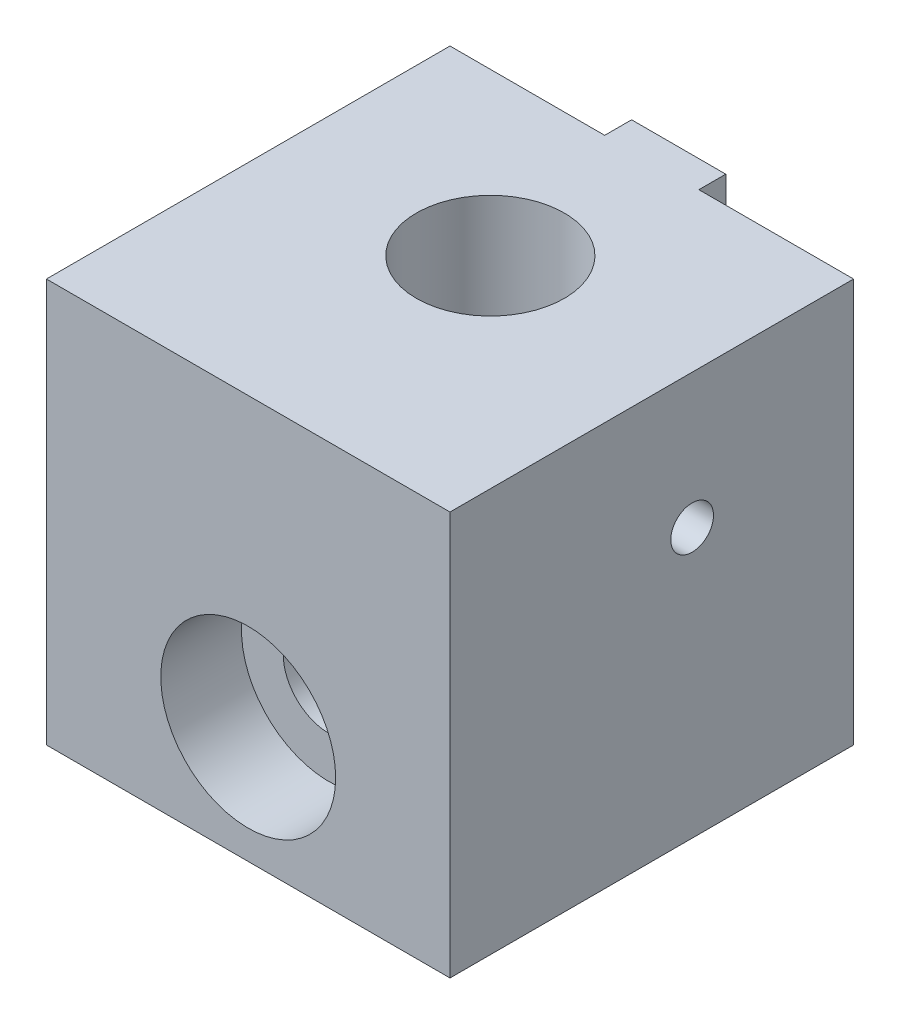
ISO-10303-21;
HEADER;
FILE_DESCRIPTION(('STEP AP214'),'2;1');
FILE_NAME('part.step','',(''),(''),'','','');
FILE_SCHEMA(('AUTOMOTIVE_DESIGN { 1 0 10303 214 1 1 1 1 }'));
ENDSEC;
DATA;
#1=APPLICATION_CONTEXT('core data for automotive mechanical design processes');
#2=APPLICATION_PROTOCOL_DEFINITION('international standard','automotive_design',2000,#1);
#3=PRODUCT_CONTEXT('',#1,'mechanical');
#4=PRODUCT('Part','Part','',(#3));
#5=PRODUCT_RELATED_PRODUCT_CATEGORY('part','',(#4));
#6=PRODUCT_DEFINITION_FORMATION('','',#4);
#7=PRODUCT_DEFINITION_CONTEXT('part definition',#1,'design');
#8=PRODUCT_DEFINITION('design','',#6,#7);
#9=PRODUCT_DEFINITION_SHAPE('','',#8);
#10=(LENGTH_UNIT() NAMED_UNIT(*) SI_UNIT(.MILLI.,.METRE.));
#11=(NAMED_UNIT(*) PLANE_ANGLE_UNIT() SI_UNIT($,.RADIAN.));
#12=(NAMED_UNIT(*) SI_UNIT($,.STERADIAN.) SOLID_ANGLE_UNIT());
#13=UNCERTAINTY_MEASURE_WITH_UNIT(LENGTH_MEASURE(1.E-05),#10,'distance_accuracy_value','');
#14=(GEOMETRIC_REPRESENTATION_CONTEXT(3) GLOBAL_UNCERTAINTY_ASSIGNED_CONTEXT((#13)) GLOBAL_UNIT_ASSIGNED_CONTEXT((#10,
#11,#12)) REPRESENTATION_CONTEXT('',''));
#15=CARTESIAN_POINT('',(0.,0.,0.));
#16=DIRECTION('',(0.,0.,1.));
#17=DIRECTION('',(1.,0.,0.));
#18=AXIS2_PLACEMENT_3D('',#15,#16,#17);
#19=CARTESIAN_POINT('',(0.,0.,0.));
#20=DIRECTION('',(0.,0.,-1.));
#21=DIRECTION('',(-1.,0.,0.));
#22=AXIS2_PLACEMENT_3D('',#19,#20,#21);
#23=PLANE('',#22);
#24=DIRECTION('',(0.,1.,0.));
#25=VECTOR('',#24,1.);
#26=CARTESIAN_POINT('',(-1.75,-7.5,0.));
#27=LINE('',#26,#25);
#28=CARTESIAN_POINT('',(-1.75,-7.5,0.));
#29=VERTEX_POINT('',#28);
#30=CARTESIAN_POINT('',(-1.75,7.5,0.));
#31=VERTEX_POINT('',#30);
#32=EDGE_CURVE('E122',#29,#31,#27,.T.);
#33=ORIENTED_EDGE('',*,*,#32,.F.);
#34=DIRECTION('',(1.,0.,0.));
#35=VECTOR('',#34,1.);
#36=CARTESIAN_POINT('',(-7.5,-7.5,0.));
#37=LINE('',#36,#35);
#38=CARTESIAN_POINT('',(-7.5,-7.5,0.));
#39=VERTEX_POINT('',#38);
#40=EDGE_CURVE('E267',#39,#29,#37,.T.);
#41=ORIENTED_EDGE('',*,*,#40,.F.);
#42=DIRECTION('',(0.,-1.,0.));
#43=VECTOR('',#42,1.);
#44=CARTESIAN_POINT('',(-7.5,-7.5,0.));
#45=LINE('',#44,#43);
#46=CARTESIAN_POINT('',(-7.5,7.5,0.));
#47=VERTEX_POINT('',#46);
#48=EDGE_CURVE('E256',#47,#39,#45,.T.);
#49=ORIENTED_EDGE('',*,*,#48,.F.);
#50=DIRECTION('',(-1.,0.,0.));
#51=VECTOR('',#50,1.);
#52=CARTESIAN_POINT('',(-7.5,7.5,0.));
#53=LINE('',#52,#51);
#54=EDGE_CURVE('E51',#31,#47,#53,.T.);
#55=ORIENTED_EDGE('',*,*,#54,.F.);
#56=EDGE_LOOP('',(#33,#41,#49,#55));
#57=FACE_BOUND('',#56,.T.);
#58=ADVANCED_FACE('F34',(#57),#23,.T.);
#59=CARTESIAN_POINT('',(7.5,-7.5,15.));
#60=DIRECTION('',(-1.,0.,0.));
#61=DIRECTION('',(0.,0.,1.));
#62=AXIS2_PLACEMENT_3D('',#59,#60,#61);
#63=PLANE('',#62);
#64=CARTESIAN_POINT('',(7.5,2.5,6.));
#65=DIRECTION('',(1.,0.,0.));
#66=DIRECTION('',(0.,0.,-1.));
#67=AXIS2_PLACEMENT_3D('',#64,#65,#66);
#68=CIRCLE('',#67,0.793749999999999);
#69=CARTESIAN_POINT('',(7.5,2.5,5.20625));
#70=VERTEX_POINT('',#69);
#71=EDGE_CURVE('E178',#70,#70,#68,.T.);
#72=ORIENTED_EDGE('',*,*,#71,.F.);
#73=EDGE_LOOP('',(#72));
#74=FACE_BOUND('',#73,.T.);
#75=DIRECTION('',(0.,1.,0.));
#76=VECTOR('',#75,1.);
#77=CARTESIAN_POINT('',(7.5,-7.5,0.));
#78=LINE('',#77,#76);
#79=CARTESIAN_POINT('',(7.5,-7.5,0.));
#80=VERTEX_POINT('',#79);
#81=CARTESIAN_POINT('',(7.5,7.5,0.));
#82=VERTEX_POINT('',#81);
#83=EDGE_CURVE('E123',#80,#82,#78,.T.);
#84=ORIENTED_EDGE('',*,*,#83,.T.);
#85=DIRECTION('',(0.,0.,-1.));
#86=VECTOR('',#85,1.);
#87=CARTESIAN_POINT('',(7.5,7.5,15.));
#88=LINE('',#87,#86);
#89=CARTESIAN_POINT('',(7.5,7.5,15.));
#90=VERTEX_POINT('',#89);
#91=EDGE_CURVE('E11',#90,#82,#88,.T.);
#92=ORIENTED_EDGE('',*,*,#91,.F.);
#93=DIRECTION('',(0.,1.,0.));
#94=VECTOR('',#93,1.);
#95=CARTESIAN_POINT('',(7.5,-7.5,15.));
#96=LINE('',#95,#94);
#97=CARTESIAN_POINT('',(7.5,-7.5,15.));
#98=VERTEX_POINT('',#97);
#99=EDGE_CURVE('E143',#98,#90,#96,.T.);
#100=ORIENTED_EDGE('',*,*,#99,.F.);
#101=DIRECTION('',(0.,0.,-1.));
#102=VECTOR('',#101,1.);
#103=CARTESIAN_POINT('',(7.5,-7.5,15.));
#104=LINE('',#103,#102);
#105=EDGE_CURVE('E270',#98,#80,#104,.T.);
#106=ORIENTED_EDGE('',*,*,#105,.T.);
#107=EDGE_LOOP('',(#84,#92,#100,#106));
#108=FACE_BOUND('',#107,.T.);
#109=ADVANCED_FACE('F36',(#74,#108),#63,.F.);
#110=CARTESIAN_POINT('',(-7.5,7.5,15.));
#111=DIRECTION('',(0.,-1.,0.));
#112=DIRECTION('',(0.,0.,-1.));
#113=AXIS2_PLACEMENT_3D('',#110,#111,#112);
#114=PLANE('',#113);
#115=CARTESIAN_POINT('',(0.,7.5,6.));
#116=DIRECTION('',(0.,1.,0.));
#117=DIRECTION('',(0.,0.,1.));
#118=AXIS2_PLACEMENT_3D('',#115,#116,#117);
#119=CIRCLE('',#118,2.75);
#120=CARTESIAN_POINT('',(0.,7.5,8.75));
#121=VERTEX_POINT('',#120);
#122=EDGE_CURVE('E166',#121,#121,#119,.T.);
#123=ORIENTED_EDGE('',*,*,#122,.F.);
#124=EDGE_LOOP('',(#123));
#125=FACE_BOUND('',#124,.T.);
#126=CARTESIAN_POINT('',(1.75,7.5,0.));
#127=VERTEX_POINT('',#126);
#128=EDGE_CURVE('E264',#82,#127,#53,.T.);
#129=ORIENTED_EDGE('',*,*,#128,.T.);
#130=DIRECTION('',(0.,0.,1.));
#131=VECTOR('',#130,1.);
#132=CARTESIAN_POINT('',(1.75,7.5,-1.));
#133=LINE('',#132,#131);
#134=CARTESIAN_POINT('',(1.75,7.5,-1.));
#135=VERTEX_POINT('',#134);
#136=EDGE_CURVE('E107',#135,#127,#133,.T.);
#137=ORIENTED_EDGE('',*,*,#136,.F.);
#138=DIRECTION('',(1.,0.,0.));
#139=VECTOR('',#138,1.);
#140=CARTESIAN_POINT('',(1.75,7.5,-1.));
#141=LINE('',#140,#139);
#142=CARTESIAN_POINT('',(-1.75,7.5,-1.));
#143=VERTEX_POINT('',#142);
#144=EDGE_CURVE('E100',#143,#135,#141,.T.);
#145=ORIENTED_EDGE('',*,*,#144,.F.);
#146=DIRECTION('',(0.,0.,1.));
#147=VECTOR('',#146,1.);
#148=CARTESIAN_POINT('',(-1.75,7.5,-1.));
#149=LINE('',#148,#147);
#150=EDGE_CURVE('E104',#143,#31,#149,.T.);
#151=ORIENTED_EDGE('',*,*,#150,.T.);
#152=ORIENTED_EDGE('',*,*,#54,.T.);
#153=DIRECTION('',(0.,0.,-1.));
#154=VECTOR('',#153,1.);
#155=CARTESIAN_POINT('',(-7.5,7.5,15.));
#156=LINE('',#155,#154);
#157=CARTESIAN_POINT('',(-7.5,7.5,15.));
#158=VERTEX_POINT('',#157);
#159=EDGE_CURVE('E43',#158,#47,#156,.T.);
#160=ORIENTED_EDGE('',*,*,#159,.F.);
#161=DIRECTION('',(-1.,0.,0.));
#162=VECTOR('',#161,1.);
#163=CARTESIAN_POINT('',(-7.5,7.5,15.));
#164=LINE('',#163,#162);
#165=EDGE_CURVE('E274',#90,#158,#164,.T.);
#166=ORIENTED_EDGE('',*,*,#165,.F.);
#167=ORIENTED_EDGE('',*,*,#91,.T.);
#168=EDGE_LOOP('',(#129,#137,#145,#151,#152,#160,#166,#167));
#169=FACE_BOUND('',#168,.T.);
#170=ADVANCED_FACE('F102',(#125,#169),#114,.F.);
#171=CARTESIAN_POINT('',(-7.5,-7.5,15.));
#172=DIRECTION('',(1.,0.,0.));
#173=DIRECTION('',(0.,0.,-1.));
#174=AXIS2_PLACEMENT_3D('',#171,#172,#173);
#175=PLANE('',#174);
#176=ORIENTED_EDGE('',*,*,#48,.T.);
#177=DIRECTION('',(0.,0.,-1.));
#178=VECTOR('',#177,1.);
#179=CARTESIAN_POINT('',(-7.5,-7.5,15.));
#180=LINE('',#179,#178);
#181=CARTESIAN_POINT('',(-7.5,-7.5,15.));
#182=VERTEX_POINT('',#181);
#183=EDGE_CURVE('E259',#182,#39,#180,.T.);
#184=ORIENTED_EDGE('',*,*,#183,.F.);
#185=DIRECTION('',(0.,-1.,0.));
#186=VECTOR('',#185,1.);
#187=CARTESIAN_POINT('',(-7.5,-7.5,15.));
#188=LINE('',#187,#186);
#189=EDGE_CURVE('E285',#158,#182,#188,.T.);
#190=ORIENTED_EDGE('',*,*,#189,.F.);
#191=ORIENTED_EDGE('',*,*,#159,.T.);
#192=EDGE_LOOP('',(#176,#184,#190,#191));
#193=FACE_BOUND('',#192,.T.);
#194=ADVANCED_FACE('F215',(#193),#175,.F.);
#195=CARTESIAN_POINT('',(-7.5,-7.5,15.));
#196=DIRECTION('',(0.,1.,0.));
#197=DIRECTION('',(0.,0.,1.));
#198=AXIS2_PLACEMENT_3D('',#195,#196,#197);
#199=PLANE('',#198);
#200=ORIENTED_EDGE('',*,*,#40,.T.);
#201=DIRECTION('',(0.,0.,1.));
#202=VECTOR('',#201,1.);
#203=CARTESIAN_POINT('',(-1.75,-7.5,-1.));
#204=LINE('',#203,#202);
#205=CARTESIAN_POINT('',(-1.75,-7.5,-1.));
#206=VERTEX_POINT('',#205);
#207=EDGE_CURVE('E136',#206,#29,#204,.T.);
#208=ORIENTED_EDGE('',*,*,#207,.F.);
#209=DIRECTION('',(-1.,0.,0.));
#210=VECTOR('',#209,1.);
#211=CARTESIAN_POINT('',(1.75,-7.5,-1.));
#212=LINE('',#211,#210);
#213=CARTESIAN_POINT('',(1.75,-7.5,-1.));
#214=VERTEX_POINT('',#213);
#215=EDGE_CURVE('E116',#214,#206,#212,.T.);
#216=ORIENTED_EDGE('',*,*,#215,.F.);
#217=DIRECTION('',(0.,0.,1.));
#218=VECTOR('',#217,1.);
#219=CARTESIAN_POINT('',(1.75,-7.5,-1.));
#220=LINE('',#219,#218);
#221=CARTESIAN_POINT('',(1.75,-7.5,0.));
#222=VERTEX_POINT('',#221);
#223=EDGE_CURVE('E127',#214,#222,#220,.T.);
#224=ORIENTED_EDGE('',*,*,#223,.T.);
#225=EDGE_CURVE('E263',#222,#80,#37,.T.);
#226=ORIENTED_EDGE('',*,*,#225,.T.);
#227=ORIENTED_EDGE('',*,*,#105,.F.);
#228=DIRECTION('',(1.,0.,0.));
#229=VECTOR('',#228,1.);
#230=CARTESIAN_POINT('',(-7.5,-7.5,15.));
#231=LINE('',#230,#229);
#232=EDGE_CURVE('E269',#182,#98,#231,.T.);
#233=ORIENTED_EDGE('',*,*,#232,.F.);
#234=ORIENTED_EDGE('',*,*,#183,.T.);
#235=EDGE_LOOP('',(#200,#208,#216,#224,#226,#227,#233,#234));
#236=FACE_BOUND('',#235,.T.);
#237=ADVANCED_FACE('F210',(#236),#199,.F.);
#238=CARTESIAN_POINT('',(0.,0.,15.));
#239=DIRECTION('',(0.,0.,-1.));
#240=DIRECTION('',(-1.,0.,0.));
#241=AXIS2_PLACEMENT_3D('',#238,#239,#240);
#242=PLANE('',#241);
#243=CARTESIAN_POINT('',(0.,-3.17783373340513,15.));
#244=DIRECTION('',(0.,0.,1.));
#245=DIRECTION('',(1.,0.,0.));
#246=AXIS2_PLACEMENT_3D('',#243,#244,#245);
#247=CIRCLE('',#246,3.25);
#248=CARTESIAN_POINT('',(3.25,-3.17783373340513,15.));
#249=VERTEX_POINT('',#248);
#250=EDGE_CURVE('E162',#249,#249,#247,.T.);
#251=ORIENTED_EDGE('',*,*,#250,.F.);
#252=EDGE_LOOP('',(#251));
#253=FACE_BOUND('',#252,.T.);
#254=ORIENTED_EDGE('',*,*,#99,.T.);
#255=ORIENTED_EDGE('',*,*,#165,.T.);
#256=ORIENTED_EDGE('',*,*,#189,.T.);
#257=ORIENTED_EDGE('',*,*,#232,.T.);
#258=EDGE_LOOP('',(#254,#255,#256,#257));
#259=FACE_BOUND('',#258,.T.);
#260=ADVANCED_FACE('F203',(#253,#259),#242,.F.);
#261=DIRECTION('',(0.,-1.,0.));
#262=VECTOR('',#261,1.);
#263=CARTESIAN_POINT('',(1.75,-7.5,0.));
#264=LINE('',#263,#262);
#265=EDGE_CURVE('E59',#127,#222,#264,.T.);
#266=ORIENTED_EDGE('',*,*,#265,.F.);
#267=ORIENTED_EDGE('',*,*,#128,.F.);
#268=ORIENTED_EDGE('',*,*,#83,.F.);
#269=ORIENTED_EDGE('',*,*,#225,.F.);
#270=EDGE_LOOP('',(#266,#267,#268,#269));
#271=FACE_BOUND('',#270,.T.);
#272=ADVANCED_FACE('F195',(#271),#23,.T.);
#273=CARTESIAN_POINT('',(-1.75,-7.5,-1.));
#274=DIRECTION('',(1.,0.,0.));
#275=DIRECTION('',(0.,0.,-1.));
#276=AXIS2_PLACEMENT_3D('',#273,#274,#275);
#277=PLANE('',#276);
#278=ORIENTED_EDGE('',*,*,#32,.T.);
#279=ORIENTED_EDGE('',*,*,#150,.F.);
#280=DIRECTION('',(0.,1.,0.));
#281=VECTOR('',#280,1.);
#282=CARTESIAN_POINT('',(-1.75,-7.5,-1.));
#283=LINE('',#282,#281);
#284=EDGE_CURVE('E111',#206,#143,#283,.T.);
#285=ORIENTED_EDGE('',*,*,#284,.F.);
#286=ORIENTED_EDGE('',*,*,#207,.T.);
#287=EDGE_LOOP('',(#278,#279,#285,#286));
#288=FACE_BOUND('',#287,.T.);
#289=ADVANCED_FACE('F121',(#288),#277,.F.);
#290=CARTESIAN_POINT('',(1.75,-7.5,-1.));
#291=DIRECTION('',(-1.,0.,0.));
#292=DIRECTION('',(0.,0.,1.));
#293=AXIS2_PLACEMENT_3D('',#290,#291,#292);
#294=PLANE('',#293);
#295=ORIENTED_EDGE('',*,*,#265,.T.);
#296=ORIENTED_EDGE('',*,*,#223,.F.);
#297=DIRECTION('',(0.,-1.,0.));
#298=VECTOR('',#297,1.);
#299=CARTESIAN_POINT('',(1.75,-7.5,-1.));
#300=LINE('',#299,#298);
#301=EDGE_CURVE('E110',#135,#214,#300,.T.);
#302=ORIENTED_EDGE('',*,*,#301,.F.);
#303=ORIENTED_EDGE('',*,*,#136,.T.);
#304=EDGE_LOOP('',(#295,#296,#302,#303));
#305=FACE_BOUND('',#304,.T.);
#306=ADVANCED_FACE('F208',(#305),#294,.F.);
#307=CARTESIAN_POINT('',(0.,0.,-1.));
#308=DIRECTION('',(0.,0.,1.));
#309=DIRECTION('',(1.,0.,0.));
#310=AXIS2_PLACEMENT_3D('',#307,#308,#309);
#311=PLANE('',#310);
#312=CARTESIAN_POINT('',(0.,-3.17783373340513,-1.));
#313=DIRECTION('',(0.,0.,1.));
#314=DIRECTION('',(1.,0.,0.));
#315=AXIS2_PLACEMENT_3D('',#312,#313,#314);
#316=CIRCLE('',#315,1.7);
#317=CARTESIAN_POINT('',(1.7,-3.17783373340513,-1.));
#318=VERTEX_POINT('',#317);
#319=EDGE_CURVE('E38',#318,#318,#316,.T.);
#320=ORIENTED_EDGE('',*,*,#319,.T.);
#321=EDGE_LOOP('',(#320));
#322=FACE_BOUND('',#321,.T.);
#323=ORIENTED_EDGE('',*,*,#284,.T.);
#324=ORIENTED_EDGE('',*,*,#144,.T.);
#325=ORIENTED_EDGE('',*,*,#301,.T.);
#326=ORIENTED_EDGE('',*,*,#215,.T.);
#327=EDGE_LOOP('',(#323,#324,#325,#326));
#328=FACE_BOUND('',#327,.T.);
#329=ADVANCED_FACE('F114',(#322,#328),#311,.F.);
#330=CARTESIAN_POINT('',(0.,-3.17783373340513,15.));
#331=DIRECTION('',(0.,0.,1.));
#332=DIRECTION('',(1.,0.,0.));
#333=AXIS2_PLACEMENT_3D('',#330,#331,#332);
#334=CYLINDRICAL_SURFACE('',#333,1.7);
#335=CARTESIAN_POINT('',(0.,-3.17783373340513,12.));
#336=DIRECTION('',(0.,0.,1.));
#337=DIRECTION('',(1.,0.,0.));
#338=AXIS2_PLACEMENT_3D('',#335,#336,#337);
#339=CIRCLE('',#338,1.7);
#340=CARTESIAN_POINT('',(1.7,-3.17783373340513,12.));
#341=VERTEX_POINT('',#340);
#342=EDGE_CURVE('E156',#341,#341,#339,.T.);
#343=ORIENTED_EDGE('',*,*,#342,.T.);
#344=EDGE_LOOP('',(#343));
#345=FACE_BOUND('',#344,.T.);
#346=ORIENTED_EDGE('',*,*,#319,.F.);
#347=EDGE_LOOP('',(#346));
#348=FACE_BOUND('',#347,.T.);
#349=ADVANCED_FACE('F224',(#345,#348),#334,.F.);
#350=CARTESIAN_POINT('',(1.7,-3.17783373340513,12.));
#351=DIRECTION('',(0.,0.,-1.));
#352=DIRECTION('',(-1.,0.,0.));
#353=AXIS2_PLACEMENT_3D('',#350,#351,#352);
#354=PLANE('',#353);
#355=ORIENTED_EDGE('',*,*,#342,.F.);
#356=EDGE_LOOP('',(#355));
#357=FACE_BOUND('',#356,.T.);
#358=CARTESIAN_POINT('',(0.,-3.17783373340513,12.));
#359=DIRECTION('',(0.,0.,1.));
#360=DIRECTION('',(1.,0.,0.));
#361=AXIS2_PLACEMENT_3D('',#358,#359,#360);
#362=CIRCLE('',#361,3.25);
#363=CARTESIAN_POINT('',(3.25,-3.17783373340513,12.));
#364=VERTEX_POINT('',#363);
#365=EDGE_CURVE('E159',#364,#364,#362,.T.);
#366=ORIENTED_EDGE('',*,*,#365,.T.);
#367=EDGE_LOOP('',(#366));
#368=FACE_BOUND('',#367,.T.);
#369=ADVANCED_FACE('F228',(#357,#368),#354,.F.);
#370=CARTESIAN_POINT('',(0.,-3.17783373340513,15.));
#371=DIRECTION('',(0.,0.,1.));
#372=DIRECTION('',(1.,0.,0.));
#373=AXIS2_PLACEMENT_3D('',#370,#371,#372);
#374=CYLINDRICAL_SURFACE('',#373,3.25);
#375=ORIENTED_EDGE('',*,*,#365,.F.);
#376=EDGE_LOOP('',(#375));
#377=FACE_BOUND('',#376,.T.);
#378=ORIENTED_EDGE('',*,*,#250,.T.);
#379=EDGE_LOOP('',(#378));
#380=FACE_BOUND('',#379,.T.);
#381=ADVANCED_FACE('F232',(#377,#380),#374,.F.);
#382=CARTESIAN_POINT('',(0.,-0.499999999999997,6.));
#383=DIRECTION('',(0.,1.,0.));
#384=DIRECTION('',(0.,0.,1.));
#385=AXIS2_PLACEMENT_3D('',#382,#383,#384);
#386=CYLINDRICAL_SURFACE('',#385,2.75);
#387=CARTESIAN_POINT('',(2.6329566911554,2.5,5.20625));
#388=CARTESIAN_POINT('',(2.63295727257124,2.54357675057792,5.20625073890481));
#389=CARTESIAN_POINT('',(2.63405035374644,2.58716092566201,5.20985075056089));
#390=CARTESIAN_POINT('',(2.63828868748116,2.67306052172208,5.22412209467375));
#391=CARTESIAN_POINT('',(2.64143474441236,2.71537543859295,5.23479619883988));
#392=CARTESIAN_POINT('',(2.6493936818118,2.79748095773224,5.26282749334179));
#393=CARTESIAN_POINT('',(2.65420394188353,2.83727541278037,5.28017418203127));
#394=CARTESIAN_POINT('',(2.66494581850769,2.9133979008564,5.32102425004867));
#395=CARTESIAN_POINT('',(2.67087757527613,2.94972549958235,5.34452839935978));
#396=CARTESIAN_POINT('',(2.68338891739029,3.01894720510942,5.39776307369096));
#397=CARTESIAN_POINT('',(2.6899815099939,3.05172472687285,5.42764217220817));
#398=CARTESIAN_POINT('',(2.70296019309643,3.11188021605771,5.49245978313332));
#399=CARTESIAN_POINT('',(2.70934625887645,3.13925753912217,5.52739889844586));
#400=CARTESIAN_POINT('',(2.72133918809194,3.18833461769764,5.60216672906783));
#401=CARTESIAN_POINT('',(2.72692893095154,3.20991654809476,5.64207576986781));
#402=CARTESIAN_POINT('',(2.73654894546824,3.24601846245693,5.72514504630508));
#403=CARTESIAN_POINT('',(2.74057952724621,3.26053985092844,5.76830463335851));
#404=CARTESIAN_POINT('',(2.74653507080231,3.28172566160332,5.85543109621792));
#405=CARTESIAN_POINT('',(2.74851320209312,3.28858884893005,5.89934594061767));
#406=CARTESIAN_POINT('',(2.75032773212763,3.29489082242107,5.98774533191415));
#407=CARTESIAN_POINT('',(2.75016454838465,3.2943310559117,6.03222976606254));
#408=CARTESIAN_POINT('',(2.74775290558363,3.28593874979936,6.11911504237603));
#409=CARTESIAN_POINT('',(2.74556611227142,3.2783212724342,6.16153863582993));
#410=CARTESIAN_POINT('',(2.73942712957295,3.25637971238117,6.24447754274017));
#411=CARTESIAN_POINT('',(2.73547483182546,3.24205521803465,6.28499273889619));
#412=CARTESIAN_POINT('',(2.72616149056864,3.20695395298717,6.36348926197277));
#413=CARTESIAN_POINT('',(2.72078531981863,3.1861074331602,6.4014375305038));
#414=CARTESIAN_POINT('',(2.70919772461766,3.13860842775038,6.47336766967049));
#415=CARTESIAN_POINT('',(2.70298611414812,3.11195464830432,6.5073486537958));
#416=CARTESIAN_POINT('',(2.69013303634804,3.05247282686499,6.57166351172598));
#417=CARTESIAN_POINT('',(2.6834841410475,3.01945794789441,6.6018233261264));
#418=CARTESIAN_POINT('',(2.67070244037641,2.94877249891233,6.6562251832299));
#419=CARTESIAN_POINT('',(2.66456967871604,2.9111015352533,6.68046672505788));
#420=CARTESIAN_POINT('',(2.65348099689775,2.83174386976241,6.72250764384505));
#421=CARTESIAN_POINT('',(2.64853525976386,2.79002645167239,6.74025191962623));
#422=CARTESIAN_POINT('',(2.64050305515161,2.70402065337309,6.76841428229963));
#423=CARTESIAN_POINT('',(2.63741603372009,2.65973304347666,6.77883455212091));
#424=CARTESIAN_POINT('',(2.63357113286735,2.57149062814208,6.79173678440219));
#425=CARTESIAN_POINT('',(2.63273616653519,2.52757757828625,6.79448160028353));
#426=CARTESIAN_POINT('',(2.63327753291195,2.43991826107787,6.79268560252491));
#427=CARTESIAN_POINT('',(2.63465358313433,2.39617197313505,6.7881457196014));
#428=CARTESIAN_POINT('',(2.63938668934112,2.31115426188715,6.77214250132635));
#429=CARTESIAN_POINT('',(2.642696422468,2.26984883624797,6.76084440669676));
#430=CARTESIAN_POINT('',(2.65087592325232,2.18972130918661,6.73183500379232));
#431=CARTESIAN_POINT('',(2.65574591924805,2.15089957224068,6.71412275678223));
#432=CARTESIAN_POINT('',(2.66664976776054,2.07576153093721,6.67227702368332));
#433=CARTESIAN_POINT('',(2.67270982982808,2.03953288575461,6.64799313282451));
#434=CARTESIAN_POINT('',(2.68525285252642,1.97156855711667,6.59387477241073));
#435=CARTESIAN_POINT('',(2.69173590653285,1.93983387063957,6.56403907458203));
#436=CARTESIAN_POINT('',(2.70466562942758,1.88062941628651,6.49843520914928));
#437=CARTESIAN_POINT('',(2.71110329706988,1.85334495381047,6.46249764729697));
#438=CARTESIAN_POINT('',(2.72298976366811,1.8051917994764,6.38640317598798));
#439=CARTESIAN_POINT('',(2.72843861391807,1.78432277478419,6.34624648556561));
#440=CARTESIAN_POINT('',(2.73769904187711,1.74979280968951,6.26312963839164));
#441=CARTESIAN_POINT('',(2.74152295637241,1.73607737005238,6.22019356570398));
#442=CARTESIAN_POINT('',(2.74715715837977,1.71609652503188,6.13249694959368));
#443=CARTESIAN_POINT('',(2.74896797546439,1.70982916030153,6.08773688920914));
#444=CARTESIAN_POINT('',(2.75034224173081,1.7050622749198,5.99938164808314));
#445=CARTESIAN_POINT('',(2.74998373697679,1.7062930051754,5.95580204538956));
#446=CARTESIAN_POINT('',(2.74724096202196,1.71584906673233,5.86949646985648));
#447=CARTESIAN_POINT('',(2.74485679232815,1.72417404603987,5.82677045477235));
#448=CARTESIAN_POINT('',(2.73835054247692,1.74752004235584,5.74376774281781));
#449=CARTESIAN_POINT('',(2.73424481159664,1.76247814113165,5.70347198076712));
#450=CARTESIAN_POINT('',(2.72472136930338,1.79860976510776,5.62594004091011));
#451=CARTESIAN_POINT('',(2.71930345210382,1.81978426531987,5.58870434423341));
#452=CARTESIAN_POINT('',(2.70752489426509,1.86849069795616,5.51712825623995));
#453=CARTESIAN_POINT('',(2.70114072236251,1.89619533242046,5.48290928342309));
#454=CARTESIAN_POINT('',(2.6882310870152,1.95685883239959,5.41951543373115));
#455=CARTESIAN_POINT('',(2.68170558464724,1.98981916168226,5.39034196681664));
#456=CARTESIAN_POINT('',(2.66904647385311,2.06112625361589,5.33708071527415));
#457=CARTESIAN_POINT('',(2.66292817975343,2.0995943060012,5.31315129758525));
#458=CARTESIAN_POINT('',(2.65201026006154,2.18017873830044,5.2721298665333));
#459=CARTESIAN_POINT('',(2.64720991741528,2.2222931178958,5.25503413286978));
#460=CARTESIAN_POINT('',(2.64001521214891,2.3034329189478,5.2299564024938));
#461=CARTESIAN_POINT('',(2.63739195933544,2.34216650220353,5.22108965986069));
#462=CARTESIAN_POINT('',(2.63386257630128,2.4205981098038,5.20923660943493));
#463=CARTESIAN_POINT('',(2.63295616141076,2.46029597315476,5.20624932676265));
#464=CARTESIAN_POINT('',(2.6329566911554,2.5,5.20625));
#465=B_SPLINE_CURVE_WITH_KNOTS('',3,(#387,#388,#389,#390,#391,#392,#393,#394,#395,#396,#397,
#398,#399,#400,#401,#402,#403,#404,#405,#406,#407,#408,#409,#410,#411,#412,#413,#414,#415,#416,
#417,#418,#419,#420,#421,#422,#423,#424,#425,#426,#427,#428,#429,#430,#431,#432,#433,#434,#435,
#436,#437,#438,#439,#440,#441,#442,#443,#444,#445,#446,#447,#448,#449,#450,#451,#452,#453,#454,
#455,#456,#457,#458,#459,#460,#461,#462,#463,#464),.UNSPECIFIED.,.T.,.F.,(4,2,2,2,2,2,2,2,2,2,2,
2,2,2,2,2,2,2,2,2,2,2,2,2,2,2,2,2,2,2,2,2,2,2,2,2,2,2,4),(0.,0.130583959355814,
0.261219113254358,0.391649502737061,0.522096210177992,0.656001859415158,0.789923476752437,
0.926390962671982,1.06283129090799,1.19564144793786,1.32842571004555,1.45729232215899,
1.5861668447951,1.71646964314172,1.84680150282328,1.98179798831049,2.11680589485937,
2.25293360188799,2.38902071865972,2.52038672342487,2.65173594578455,2.77999786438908,
2.90827856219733,3.03978816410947,3.17132689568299,3.30741173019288,3.44348950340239,
3.57851484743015,3.71350466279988,3.8436675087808,3.97382389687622,4.10277125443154,
4.23173884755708,4.36460175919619,4.497501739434,4.63398575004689,4.77039535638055,
4.88939387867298,5.00837266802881),.UNSPECIFIED.);
#466=CARTESIAN_POINT('',(2.6329566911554,2.5,5.20625));
#467=VERTEX_POINT('',#466);
#468=EDGE_CURVE('E169',#467,#467,#465,.T.);
#469=ORIENTED_EDGE('',*,*,#468,.T.);
#470=EDGE_LOOP('',(#469));
#471=FACE_BOUND('',#470,.T.);
#472=CARTESIAN_POINT('',(0.,-0.499999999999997,6.));
#473=DIRECTION('',(0.,1.,0.));
#474=DIRECTION('',(0.,0.,1.));
#475=AXIS2_PLACEMENT_3D('',#472,#473,#474);
#476=CIRCLE('',#475,2.75);
#477=CARTESIAN_POINT('',(0.,-0.499999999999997,8.75));
#478=VERTEX_POINT('',#477);
#479=EDGE_CURVE('E165',#478,#478,#476,.T.);
#480=ORIENTED_EDGE('',*,*,#479,.F.);
#481=EDGE_LOOP('',(#480));
#482=FACE_BOUND('',#481,.T.);
#483=ORIENTED_EDGE('',*,*,#122,.T.);
#484=EDGE_LOOP('',(#483));
#485=FACE_BOUND('',#484,.T.);
#486=ADVANCED_FACE('F189',(#471,#482,#485),#386,.F.);
#487=CARTESIAN_POINT('',(0.,-0.499999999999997,6.));
#488=DIRECTION('',(0.,1.,0.));
#489=DIRECTION('',(0.,0.,1.));
#490=AXIS2_PLACEMENT_3D('',#487,#488,#489);
#491=PLANE('',#490);
#492=ORIENTED_EDGE('',*,*,#479,.T.);
#493=EDGE_LOOP('',(#492));
#494=FACE_BOUND('',#493,.T.);
#495=ADVANCED_FACE('F184',(#494),#491,.T.);
#496=CARTESIAN_POINT('',(7.5,2.5,6.));
#497=DIRECTION('',(1.,0.,0.));
#498=DIRECTION('',(0.,0.,-1.));
#499=AXIS2_PLACEMENT_3D('',#496,#497,#498);
#500=CYLINDRICAL_SURFACE('',#499,0.793749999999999);
#501=ORIENTED_EDGE('',*,*,#468,.F.);
#502=EDGE_LOOP('',(#501));
#503=FACE_BOUND('',#502,.T.);
#504=ORIENTED_EDGE('',*,*,#71,.T.);
#505=EDGE_LOOP('',(#504));
#506=FACE_BOUND('',#505,.T.);
#507=ADVANCED_FACE('F181',(#503,#506),#500,.F.);
#508=CLOSED_SHELL('',(#58,#109,#170,#194,#237,#260,#272,#289,#306,#329,#349,#369,#381,#486,#495,#507));
#509=MANIFOLD_SOLID_BREP('B2',#508);
#510=ADVANCED_BREP_SHAPE_REPRESENTATION('',(#18,#509),#14);
#511=SHAPE_DEFINITION_REPRESENTATION(#9,#510);
ENDSEC;
END-ISO-10303-21;
